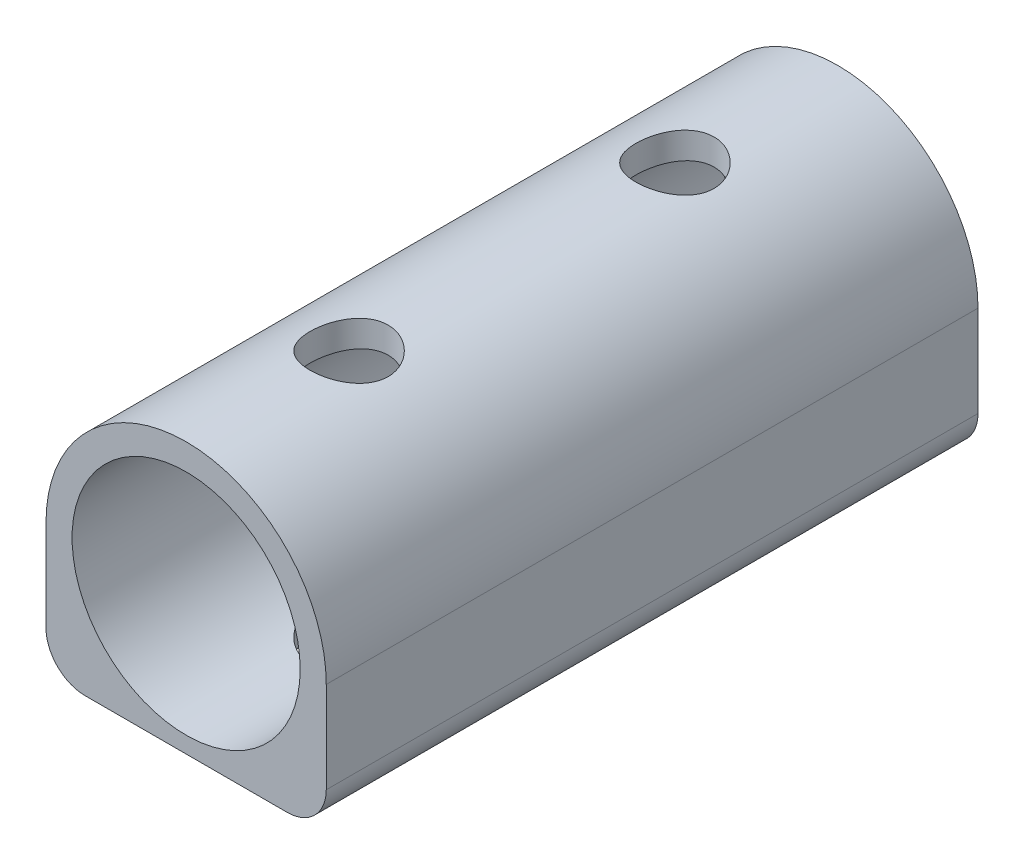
from build123d import *

# Parameters (mm, degrees)
BASE_EXTRUDE_DEPTH = 100
SKETCH2_R          = 17.5
CUT_EXTRUDE1_DEPTH = 105.52033295
SKETCH3_R          = 6
CUT_EXTRUDE2_DEPTH = 111.383422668
FILLET1_R          = 6


with BuildPart() as part:
    # Sketch1 → Base-Extrude (new body)
    with BuildSketch(Plane.XY):
        with BuildLine():
            Line((-21.5, -20), (-21.5, 0))
            ThreePointArc((-21.5, 0), (0, 21.5), (21.5, 0))
            Line((21.5, 0), (21.5, -20))
            Line((21.5, -20), (-21.5, -20))
        make_face()
    extrude(amount=BASE_EXTRUDE_DEPTH)

    # Sketch2 → Cut-Extrude1 (cut, through all)
    with BuildSketch(Plane.XY.offset(100)):
        Circle(SKETCH2_R)
    extrude(amount=-CUT_EXTRUDE1_DEPTH, mode=Mode.SUBTRACT)

    # Sketch3 → Cut-Extrude2 (cut, through all)
    with BuildSketch(Plane.XZ.offset(20)):
        with Locations((0, 25)):
            Circle(SKETCH3_R)
        with Locations((0, 75)):
            Circle(SKETCH3_R)
    extrude(amount=-CUT_EXTRUDE2_DEPTH, mode=Mode.SUBTRACT)

    # Fillet1
    fillet1_edges = [part.edges().sort_by_distance(p)[0] for p in [
        (21.5, -20, 50),
        (-21.5, -20, 50),
    ]]
    fillet(fillet1_edges, radius=FILLET1_R)


solid = part.part
